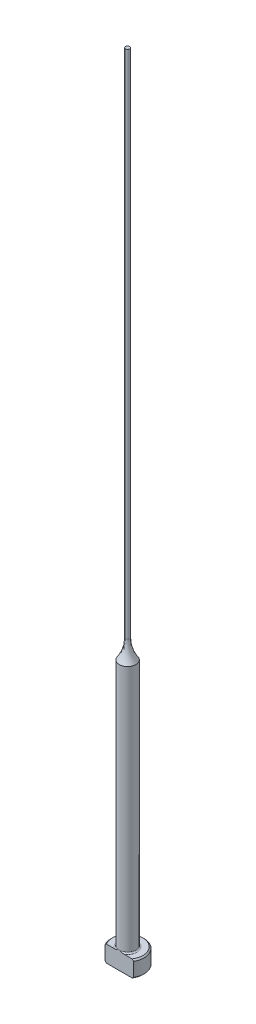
from build123d import *

# Parameters (mm, degrees)
CHAMFER1_SIZE      = 0.254
FILLET1_R          = 0.254
CUT_EXTRUDE1_DEPTH = 153.466131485


with BuildPart() as part:
    # Sketch1 → Revolve1 (revolve)
    with BuildSketch(Plane.XY, mode=Mode.PRIVATE) as revolve1_sk:
        with BuildLine():
            Line((0, 0), (-3.175, 0))
            Line((-3.175, 0), (-3.175, 3.175))
            Line((-3.175, 3.175), (-1.5875, 3.175))
            Line((-1.5875, 3.175), (-1.5875, 50.8))
            ThreePointArc((-1.5875, 50.8), (-0.701386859, 52.557887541), (-0.39624, 54.50268843))
            Line((-0.39624, 54.50268843), (-0.39624, 152.4))
            Line((-0.39624, 152.4), (0, 152.4))
            Line((0, 152.4), (0, 0))
        make_face()
    revolve(revolve1_sk.sketch.rotate(Axis((0, 259.958771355, 0), (0, -1, 0)), 270), axis=Axis((0, 259.958771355, 0), (0, -1, 0)))

    # Chamfer1
    chamfer1_edges = [part.edges().sort_by_distance(p)[0] for p in [
        (0, 0, -3.175),
        (0, 3.175, -3.175),
    ]]
    chamfer(chamfer1_edges, length=CHAMFER1_SIZE)

    # Fillet1
    fillet1_edges = [part.edges().sort_by_distance(p)[0] for p in [
        (0, 3.175, -1.5875),
    ]]
    fillet(fillet1_edges, radius=FILLET1_R)

    # Sketch2 → Cut-Extrude1 (cut, through all)
    with BuildSketch(Plane.XZ):
        with BuildLine():
            Line((-2.749630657, 1.5875), (2.749630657, 1.5875))
            ThreePointArc((2.749630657, 1.5875), (0, 3.175), (-2.749630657, 1.5875))
        make_face()
    extrude(amount=-CUT_EXTRUDE1_DEPTH, mode=Mode.SUBTRACT)


solid = part.part
